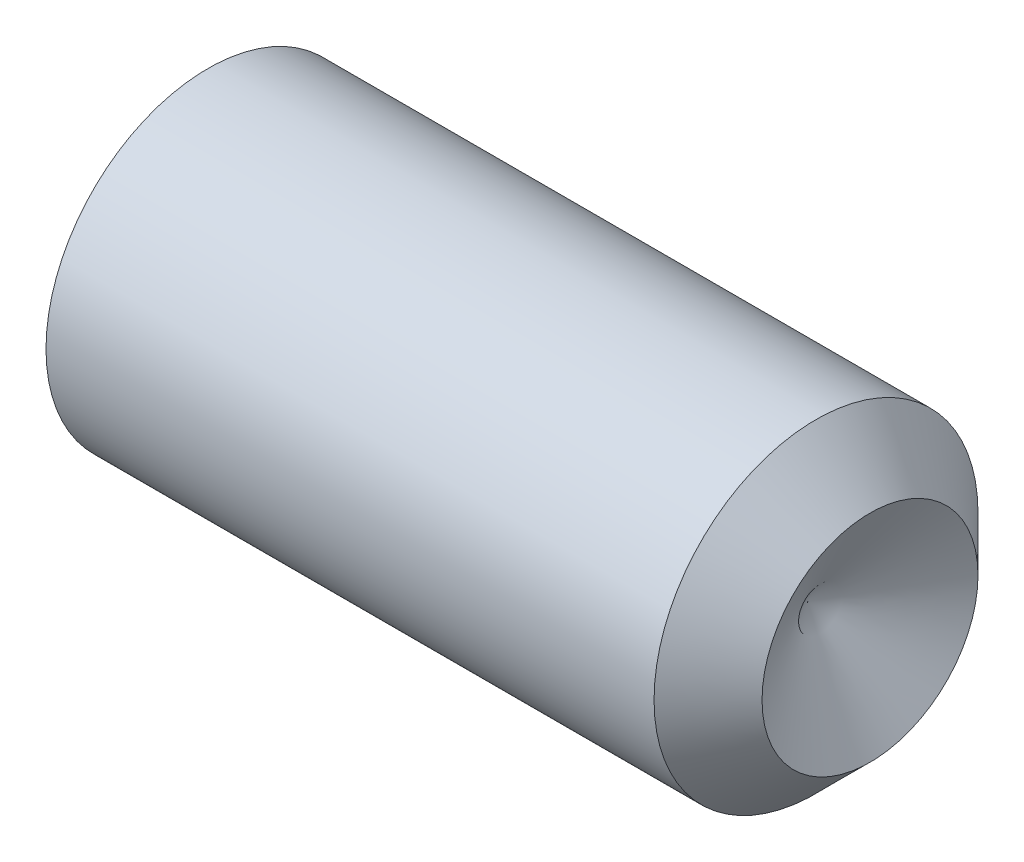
from build123d import *

# Parameters (mm, degrees)
HEX_2_DEPTH = 15


with BuildPart() as part:
    # BodySke → BaseBody (revolve)
    with BuildSketch(Plane.XY, mode=Mode.PRIVATE) as basebody_sk:
        Polygon((0, 0), (0, 10.352), (0.951473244, 12), (46, 12), (50, 8), (45.381197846, 0), align=None)
    revolve(basebody_sk.sketch.rotate(Axis((-12.7, 0, 0), (1, 0, 0)), 90), axis=Axis((-12.7, 0, 0), (1, 0, 0)))

    # Sketch2 → Hex 2 (cut)
    with BuildSketch(Plane.ZY):
        Polygon((3.464101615, 6), (-3.464101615, 6), (-6.92820323, 0), (-3.464101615, -6), (3.464101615, -6), (6.92820323, 0), align=None)
    extrude(amount=-HEX_2_DEPTH, mode=Mode.SUBTRACT)


solid = part.part
